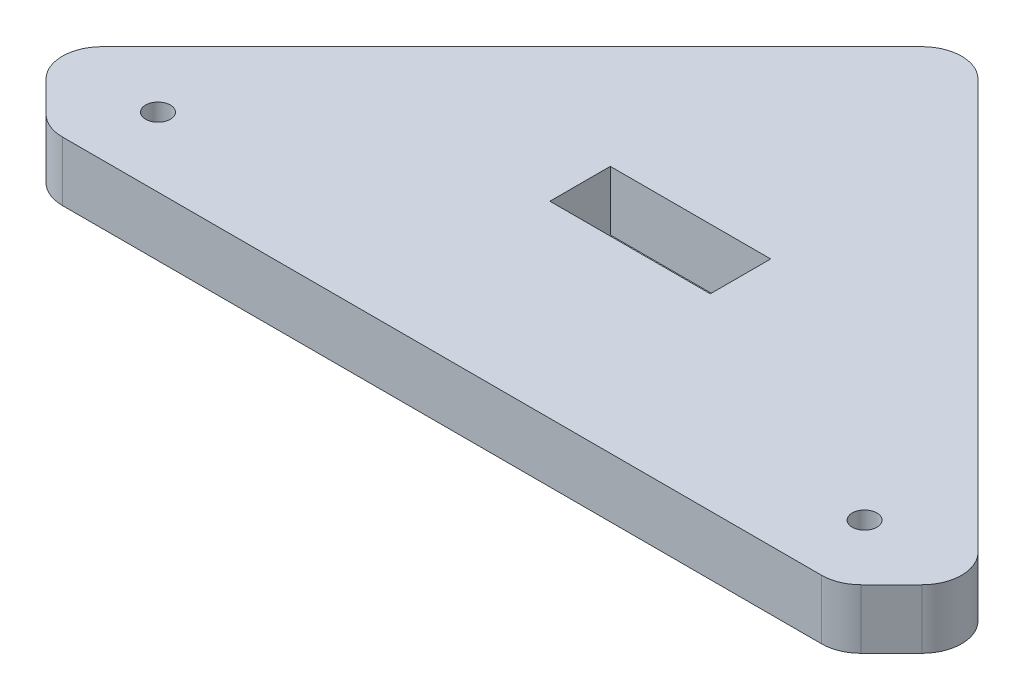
from build123d import *

# Parameters (mm, degrees)
IZIM1_R                     = 1.25
IZIM1_W                     = 16.2
IZIM1_H                     = 6.1
Y_KSEKLIK_EKSTR_ZYON1_DEPTH = 6
RADYUS1_R                   = 4


with BuildPart() as part:
    # izim1 → Y_kseklik-Ekstr_zyon1 (new body)
    with BuildSketch(Plane(origin=(0, 0, 0), x_dir=(1, 0, 0), z_dir=(0, 1, 0))):
        Polygon((-40, 0), (40, 0), (47.071067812, 7.071067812), (0, 54.142135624), (-47.071067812, 7.071067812), align=None)
        with Locations(Location((-35.686291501, 7, 0), (0, 0, 270))):
            Circle(IZIM1_R, mode=Mode.SUBTRACT)
        with Locations(Location((35.686291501, 7, 0), (0, 0, 270))):
            Circle(IZIM1_R, mode=Mode.SUBTRACT)
        with Locations((0, 22.05)):
            Rectangle(IZIM1_W, IZIM1_H, mode=Mode.SUBTRACT)
    extrude(amount=Y_KSEKLIK_EKSTR_ZYON1_DEPTH)

    # Radyus1
    radyus1_edges = [part.edges().sort_by_distance(p)[0] for p in [
        (40, 3, 0),
        (-40, 3, 0),
        (-47.071067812, 3, -7.071067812),
        (0, 3, -54.142135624),
        (47.071067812, 3, -7.071067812),
    ]]
    fillet(radyus1_edges, radius=RADYUS1_R)


solid = part.part
